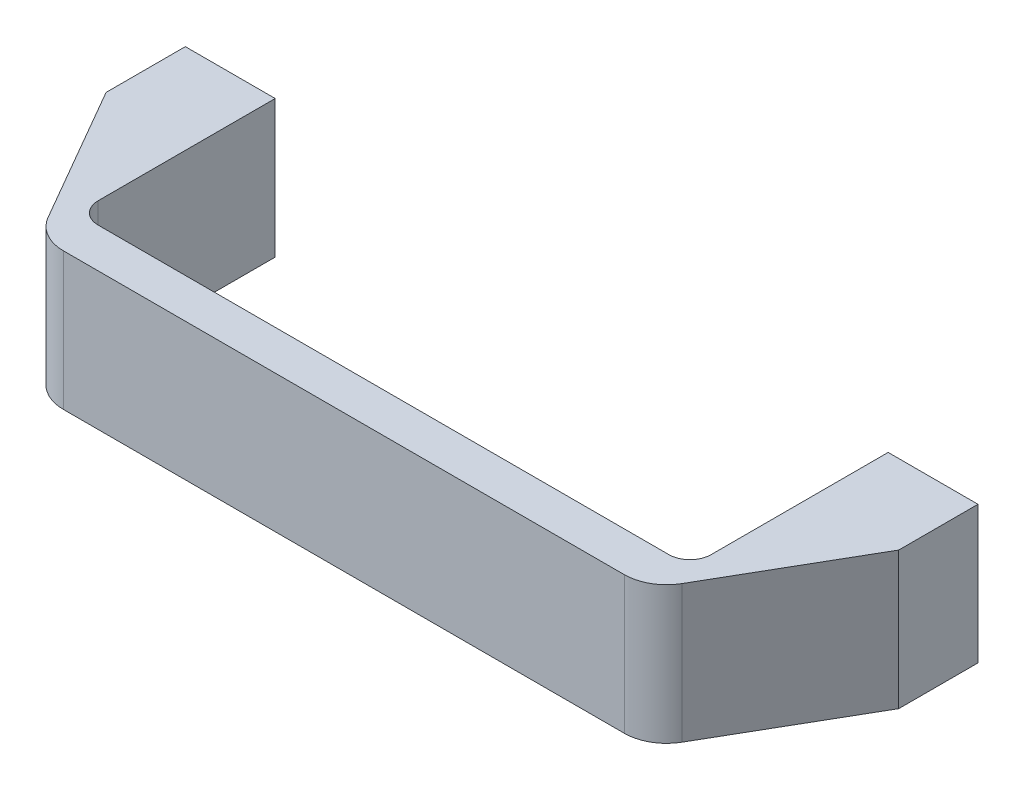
ISO-10303-21;
HEADER;
FILE_DESCRIPTION(('STEP AP214'),'2;1');
FILE_NAME('part.step','',(''),(''),'','','');
FILE_SCHEMA(('AUTOMOTIVE_DESIGN { 1 0 10303 214 1 1 1 1 }'));
ENDSEC;
DATA;
#1=APPLICATION_CONTEXT('core data for automotive mechanical design processes');
#2=APPLICATION_PROTOCOL_DEFINITION('international standard','automotive_design',2000,#1);
#3=PRODUCT_CONTEXT('',#1,'mechanical');
#4=PRODUCT('Part','Part','',(#3));
#5=PRODUCT_RELATED_PRODUCT_CATEGORY('part','',(#4));
#6=PRODUCT_DEFINITION_FORMATION('','',#4);
#7=PRODUCT_DEFINITION_CONTEXT('part definition',#1,'design');
#8=PRODUCT_DEFINITION('design','',#6,#7);
#9=PRODUCT_DEFINITION_SHAPE('','',#8);
#10=(LENGTH_UNIT() NAMED_UNIT(*) SI_UNIT(.MILLI.,.METRE.));
#11=(NAMED_UNIT(*) PLANE_ANGLE_UNIT() SI_UNIT($,.RADIAN.));
#12=(NAMED_UNIT(*) SI_UNIT($,.STERADIAN.) SOLID_ANGLE_UNIT());
#13=UNCERTAINTY_MEASURE_WITH_UNIT(LENGTH_MEASURE(1.E-05),#10,'distance_accuracy_value','');
#14=(GEOMETRIC_REPRESENTATION_CONTEXT(3) GLOBAL_UNCERTAINTY_ASSIGNED_CONTEXT((#13)) GLOBAL_UNIT_ASSIGNED_CONTEXT((#10,
#11,#12)) REPRESENTATION_CONTEXT('',''));
#15=CARTESIAN_POINT('',(0.,0.,0.));
#16=DIRECTION('',(0.,0.,1.));
#17=DIRECTION('',(1.,0.,0.));
#18=AXIS2_PLACEMENT_3D('',#15,#16,#17);
#19=CARTESIAN_POINT('',(-9.,-13.,0.));
#20=DIRECTION('',(0.,0.,-1.));
#21=DIRECTION('',(0.,1.,0.));
#22=AXIS2_PLACEMENT_3D('',#19,#20,#21);
#23=PLANE('',#22);
#24=DIRECTION('',(1.,0.,0.));
#25=VECTOR('',#24,1.);
#26=CARTESIAN_POINT('',(66.,-13.,0.));
#27=LINE('',#26,#25);
#28=CARTESIAN_POINT('',(-9.,-13.,0.));
#29=VERTEX_POINT('',#28);
#30=CARTESIAN_POINT('',(8.,-13.,0.));
#31=VERTEX_POINT('',#30);
#32=EDGE_CURVE('E130',#29,#31,#27,.T.);
#33=ORIENTED_EDGE('',*,*,#32,.F.);
#34=DIRECTION('',(0.,-1.,0.));
#35=VECTOR('',#34,1.);
#36=CARTESIAN_POINT('',(-9.,-13.,0.));
#37=LINE('',#36,#35);
#38=CARTESIAN_POINT('',(-9.,13.,0.));
#39=VERTEX_POINT('',#38);
#40=EDGE_CURVE('E138',#39,#29,#37,.T.);
#41=ORIENTED_EDGE('',*,*,#40,.F.);
#42=DIRECTION('',(1.,0.,0.));
#43=VECTOR('',#42,1.);
#44=CARTESIAN_POINT('',(66.,13.,0.));
#45=LINE('',#44,#43);
#46=CARTESIAN_POINT('',(8.,13.,0.));
#47=VERTEX_POINT('',#46);
#48=EDGE_CURVE('E137',#39,#47,#45,.T.);
#49=ORIENTED_EDGE('',*,*,#48,.T.);
#50=DIRECTION('',(0.,1.,0.));
#51=VECTOR('',#50,1.);
#52=CARTESIAN_POINT('',(8.,-13.,0.));
#53=LINE('',#52,#51);
#54=EDGE_CURVE('E133',#31,#47,#53,.T.);
#55=ORIENTED_EDGE('',*,*,#54,.F.);
#56=EDGE_LOOP('',(#33,#41,#49,#55));
#57=FACE_BOUND('',#56,.T.);
#58=CARTESIAN_POINT('',(0.,0.,0.));
#59=DIRECTION('',(0.,0.,-1.));
#60=DIRECTION('',(0.,1.,0.));
#61=AXIS2_PLACEMENT_3D('',#58,#59,#60);
#62=CIRCLE('',#61,4.);
#63=CARTESIAN_POINT('',(0.,4.,0.));
#64=VERTEX_POINT('',#63);
#65=EDGE_CURVE('E326',#64,#64,#62,.T.);
#66=ORIENTED_EDGE('',*,*,#65,.F.);
#67=EDGE_LOOP('',(#66));
#68=FACE_BOUND('',#67,.T.);
#69=ADVANCED_FACE('F14',(#57,#68),#23,.T.);
#70=CARTESIAN_POINT('',(124.,-13.,33.5));
#71=DIRECTION('',(-1.,0.,0.));
#72=DIRECTION('',(0.,-1.,0.));
#73=AXIS2_PLACEMENT_3D('',#70,#71,#72);
#74=PLANE('',#73);
#75=DIRECTION('',(0.,0.,1.));
#76=VECTOR('',#75,1.);
#77=CARTESIAN_POINT('',(124.,-13.,0.));
#78=LINE('',#77,#76);
#79=CARTESIAN_POINT('',(124.,-13.,33.5));
#80=VERTEX_POINT('',#79);
#81=CARTESIAN_POINT('',(124.,-13.,0.));
#82=VERTEX_POINT('',#81);
#83=EDGE_CURVE('E183',#80,#82,#78,.F.);
#84=ORIENTED_EDGE('',*,*,#83,.F.);
#85=DIRECTION('',(0.,-1.,0.));
#86=VECTOR('',#85,1.);
#87=CARTESIAN_POINT('',(124.,-13.,33.5));
#88=LINE('',#87,#86);
#89=CARTESIAN_POINT('',(124.,13.,33.5));
#90=VERTEX_POINT('',#89);
#91=EDGE_CURVE('E186',#80,#90,#88,.F.);
#92=ORIENTED_EDGE('',*,*,#91,.T.);
#93=DIRECTION('',(0.,0.,1.));
#94=VECTOR('',#93,1.);
#95=CARTESIAN_POINT('',(124.,13.,0.));
#96=LINE('',#95,#94);
#97=CARTESIAN_POINT('',(124.,13.,0.));
#98=VERTEX_POINT('',#97);
#99=EDGE_CURVE('E165',#90,#98,#96,.F.);
#100=ORIENTED_EDGE('',*,*,#99,.T.);
#101=DIRECTION('',(0.,1.,0.));
#102=VECTOR('',#101,1.);
#103=CARTESIAN_POINT('',(124.,-13.,0.));
#104=LINE('',#103,#102);
#105=EDGE_CURVE('E215',#82,#98,#104,.T.);
#106=ORIENTED_EDGE('',*,*,#105,.F.);
#107=EDGE_LOOP('',(#84,#92,#100,#106));
#108=FACE_BOUND('',#107,.T.);
#109=ADVANCED_FACE('F284',(#108),#74,.T.);
#110=CARTESIAN_POINT('',(124.,-13.,0.));
#111=DIRECTION('',(0.,0.,-1.));
#112=DIRECTION('',(0.,1.,0.));
#113=AXIS2_PLACEMENT_3D('',#110,#111,#112);
#114=PLANE('',#113);
#115=DIRECTION('',(1.,0.,0.));
#116=VECTOR('',#115,1.);
#117=CARTESIAN_POINT('',(66.,-13.,0.));
#118=LINE('',#117,#116);
#119=CARTESIAN_POINT('',(141.,-13.,0.));
#120=VERTEX_POINT('',#119);
#121=EDGE_CURVE('E213',#82,#120,#118,.T.);
#122=ORIENTED_EDGE('',*,*,#121,.F.);
#123=ORIENTED_EDGE('',*,*,#105,.T.);
#124=DIRECTION('',(1.,0.,0.));
#125=VECTOR('',#124,1.);
#126=CARTESIAN_POINT('',(66.,13.,0.));
#127=LINE('',#126,#125);
#128=CARTESIAN_POINT('',(141.,13.,0.));
#129=VERTEX_POINT('',#128);
#130=EDGE_CURVE('E163',#98,#129,#127,.T.);
#131=ORIENTED_EDGE('',*,*,#130,.T.);
#132=DIRECTION('',(0.,1.,0.));
#133=VECTOR('',#132,1.);
#134=CARTESIAN_POINT('',(141.,-13.,0.));
#135=LINE('',#134,#133);
#136=EDGE_CURVE('E209',#120,#129,#135,.T.);
#137=ORIENTED_EDGE('',*,*,#136,.F.);
#138=EDGE_LOOP('',(#122,#123,#131,#137));
#139=FACE_BOUND('',#138,.T.);
#140=CARTESIAN_POINT('',(132.,0.,0.));
#141=DIRECTION('',(0.,0.,-1.));
#142=DIRECTION('',(0.,1.,0.));
#143=AXIS2_PLACEMENT_3D('',#140,#141,#142);
#144=CIRCLE('',#143,4.);
#145=CARTESIAN_POINT('',(132.,4.,0.));
#146=VERTEX_POINT('',#145);
#147=EDGE_CURVE('E229',#146,#146,#144,.T.);
#148=ORIENTED_EDGE('',*,*,#147,.F.);
#149=EDGE_LOOP('',(#148));
#150=FACE_BOUND('',#149,.T.);
#151=ADVANCED_FACE('F288',(#139,#150),#114,.T.);
#152=CARTESIAN_POINT('',(141.,-13.,0.));
#153=DIRECTION('',(1.,0.,0.));
#154=DIRECTION('',(0.,1.,0.));
#155=AXIS2_PLACEMENT_3D('',#152,#153,#154);
#156=PLANE('',#155);
#157=DIRECTION('',(0.,0.,1.));
#158=VECTOR('',#157,1.);
#159=CARTESIAN_POINT('',(141.,-13.,0.));
#160=LINE('',#159,#158);
#161=CARTESIAN_POINT('',(141.,-13.,15.));
#162=VERTEX_POINT('',#161);
#163=EDGE_CURVE('E210',#120,#162,#160,.T.);
#164=ORIENTED_EDGE('',*,*,#163,.F.);
#165=ORIENTED_EDGE('',*,*,#136,.T.);
#166=DIRECTION('',(0.,0.,1.));
#167=VECTOR('',#166,1.);
#168=CARTESIAN_POINT('',(141.,13.,0.));
#169=LINE('',#168,#167);
#170=CARTESIAN_POINT('',(141.,13.,15.));
#171=VERTEX_POINT('',#170);
#172=EDGE_CURVE('E90',#129,#171,#169,.T.);
#173=ORIENTED_EDGE('',*,*,#172,.T.);
#174=DIRECTION('',(0.,-1.,0.));
#175=VECTOR('',#174,1.);
#176=CARTESIAN_POINT('',(141.,-13.,15.));
#177=LINE('',#176,#175);
#178=EDGE_CURVE('E207',#162,#171,#177,.F.);
#179=ORIENTED_EDGE('',*,*,#178,.F.);
#180=EDGE_LOOP('',(#164,#165,#173,#179));
#181=FACE_BOUND('',#180,.T.);
#182=ADVANCED_FACE('F291',(#181),#156,.T.);
#183=CARTESIAN_POINT('',(141.,-13.,15.));
#184=DIRECTION('',(0.866025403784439,0.,0.5));
#185=DIRECTION('',(-0.5,0.,0.866025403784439));
#186=AXIS2_PLACEMENT_3D('',#183,#184,#185);
#187=PLANE('',#186);
#188=DIRECTION('',(-0.5,0.,0.866025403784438));
#189=VECTOR('',#188,1.);
#190=CARTESIAN_POINT('',(141.,-13.,15.));
#191=LINE('',#190,#189);
#192=CARTESIAN_POINT('',(125.98889300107,-13.,41.));
#193=VERTEX_POINT('',#192);
#194=EDGE_CURVE('E179',#162,#193,#191,.T.);
#195=ORIENTED_EDGE('',*,*,#194,.F.);
#196=ORIENTED_EDGE('',*,*,#178,.T.);
#197=DIRECTION('',(-0.5,0.,0.866025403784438));
#198=VECTOR('',#197,1.);
#199=CARTESIAN_POINT('',(141.,13.,15.));
#200=LINE('',#199,#198);
#201=CARTESIAN_POINT('',(125.98889300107,13.,41.));
#202=VERTEX_POINT('',#201);
#203=EDGE_CURVE('E80',#171,#202,#200,.T.);
#204=ORIENTED_EDGE('',*,*,#203,.T.);
#205=DIRECTION('',(0.,-1.,0.));
#206=VECTOR('',#205,1.);
#207=CARTESIAN_POINT('',(125.98889300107,-13.,41.));
#208=LINE('',#207,#206);
#209=EDGE_CURVE('E205',#193,#202,#208,.F.);
#210=ORIENTED_EDGE('',*,*,#209,.F.);
#211=EDGE_LOOP('',(#195,#196,#204,#210));
#212=FACE_BOUND('',#211,.T.);
#213=ADVANCED_FACE('F293',(#212),#187,.T.);
#214=CARTESIAN_POINT('',(119.060689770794,-13.,37.));
#215=DIRECTION('',(0.,-1.,0.));
#216=DIRECTION('',(1.,0.,0.));
#217=AXIS2_PLACEMENT_3D('',#214,#215,#216);
#218=CYLINDRICAL_SURFACE('',#217,8.);
#219=CARTESIAN_POINT('',(119.060689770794,-13.,37.));
#220=DIRECTION('',(0.,-1.,0.));
#221=DIRECTION('',(1.,0.,0.));
#222=AXIS2_PLACEMENT_3D('',#219,#220,#221);
#223=CIRCLE('',#222,8.);
#224=CARTESIAN_POINT('',(119.060689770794,-13.,45.));
#225=VERTEX_POINT('',#224);
#226=EDGE_CURVE('E176',#193,#225,#223,.T.);
#227=ORIENTED_EDGE('',*,*,#226,.F.);
#228=ORIENTED_EDGE('',*,*,#209,.T.);
#229=CARTESIAN_POINT('',(119.060689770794,13.,37.));
#230=DIRECTION('',(0.,-1.,0.));
#231=DIRECTION('',(1.,0.,0.));
#232=AXIS2_PLACEMENT_3D('',#229,#230,#231);
#233=CIRCLE('',#232,8.);
#234=CARTESIAN_POINT('',(119.060689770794,13.,45.));
#235=VERTEX_POINT('',#234);
#236=EDGE_CURVE('E17',#202,#235,#233,.T.);
#237=ORIENTED_EDGE('',*,*,#236,.T.);
#238=DIRECTION('',(0.,-1.,0.));
#239=VECTOR('',#238,1.);
#240=CARTESIAN_POINT('',(119.060689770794,-13.,45.));
#241=LINE('',#240,#239);
#242=EDGE_CURVE('E203',#225,#235,#241,.F.);
#243=ORIENTED_EDGE('',*,*,#242,.F.);
#244=EDGE_LOOP('',(#227,#228,#237,#243));
#245=FACE_BOUND('',#244,.T.);
#246=ADVANCED_FACE('F297',(#245),#218,.T.);
#247=CARTESIAN_POINT('',(66.,-13.,45.));
#248=DIRECTION('',(0.,0.,1.));
#249=DIRECTION('',(0.,-1.,0.));
#250=AXIS2_PLACEMENT_3D('',#247,#248,#249);
#251=PLANE('',#250);
#252=DIRECTION('',(1.,0.,0.));
#253=VECTOR('',#252,1.);
#254=CARTESIAN_POINT('',(66.,-13.,45.));
#255=LINE('',#254,#253);
#256=CARTESIAN_POINT('',(12.9393102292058,-13.,45.));
#257=VERTEX_POINT('',#256);
#258=EDGE_CURVE('E175',#225,#257,#255,.F.);
#259=ORIENTED_EDGE('',*,*,#258,.F.);
#260=ORIENTED_EDGE('',*,*,#242,.T.);
#261=DIRECTION('',(1.,0.,0.));
#262=VECTOR('',#261,1.);
#263=CARTESIAN_POINT('',(66.,13.,45.));
#264=LINE('',#263,#262);
#265=CARTESIAN_POINT('',(12.9393102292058,13.,45.));
#266=VERTEX_POINT('',#265);
#267=EDGE_CURVE('E187',#235,#266,#264,.F.);
#268=ORIENTED_EDGE('',*,*,#267,.T.);
#269=DIRECTION('',(0.,-1.,0.));
#270=VECTOR('',#269,1.);
#271=CARTESIAN_POINT('',(12.9393102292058,-13.,45.));
#272=LINE('',#271,#270);
#273=EDGE_CURVE('E200',#257,#266,#272,.F.);
#274=ORIENTED_EDGE('',*,*,#273,.F.);
#275=EDGE_LOOP('',(#259,#260,#268,#274));
#276=FACE_BOUND('',#275,.T.);
#277=ADVANCED_FACE('F299',(#276),#251,.T.);
#278=CARTESIAN_POINT('',(12.9393102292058,-13.,37.));
#279=DIRECTION('',(0.,-1.,0.));
#280=DIRECTION('',(1.,0.,0.));
#281=AXIS2_PLACEMENT_3D('',#278,#279,#280);
#282=CYLINDRICAL_SURFACE('',#281,8.);
#283=CARTESIAN_POINT('',(12.9393102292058,-13.,37.));
#284=DIRECTION('',(0.,-1.,0.));
#285=DIRECTION('',(1.,0.,0.));
#286=AXIS2_PLACEMENT_3D('',#283,#284,#285);
#287=CIRCLE('',#286,8.);
#288=CARTESIAN_POINT('',(6.0111069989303,-13.,41.));
#289=VERTEX_POINT('',#288);
#290=EDGE_CURVE('E171',#257,#289,#287,.T.);
#291=ORIENTED_EDGE('',*,*,#290,.F.);
#292=ORIENTED_EDGE('',*,*,#273,.T.);
#293=CARTESIAN_POINT('',(12.9393102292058,13.,37.));
#294=DIRECTION('',(0.,-1.,0.));
#295=DIRECTION('',(1.,0.,0.));
#296=AXIS2_PLACEMENT_3D('',#293,#294,#295);
#297=CIRCLE('',#296,8.);
#298=CARTESIAN_POINT('',(6.0111069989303,13.,41.));
#299=VERTEX_POINT('',#298);
#300=EDGE_CURVE('E149',#266,#299,#297,.T.);
#301=ORIENTED_EDGE('',*,*,#300,.T.);
#302=DIRECTION('',(0.,-1.,0.));
#303=VECTOR('',#302,1.);
#304=CARTESIAN_POINT('',(6.0111069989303,-13.,41.));
#305=LINE('',#304,#303);
#306=EDGE_CURVE('E144',#289,#299,#305,.F.);
#307=ORIENTED_EDGE('',*,*,#306,.F.);
#308=EDGE_LOOP('',(#291,#292,#301,#307));
#309=FACE_BOUND('',#308,.T.);
#310=ADVANCED_FACE('F300',(#309),#282,.T.);
#311=CARTESIAN_POINT('',(6.0111069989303,-13.,41.));
#312=DIRECTION('',(-0.866025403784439,0.,0.5));
#313=DIRECTION('',(-0.5,0.,-0.866025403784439));
#314=AXIS2_PLACEMENT_3D('',#311,#312,#313);
#315=PLANE('',#314);
#316=DIRECTION('',(-0.5,0.,-0.866025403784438));
#317=VECTOR('',#316,1.);
#318=CARTESIAN_POINT('',(6.0111069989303,-13.,41.));
#319=LINE('',#318,#317);
#320=CARTESIAN_POINT('',(-9.,-13.,15.));
#321=VERTEX_POINT('',#320);
#322=EDGE_CURVE('E174',#289,#321,#319,.T.);
#323=ORIENTED_EDGE('',*,*,#322,.F.);
#324=ORIENTED_EDGE('',*,*,#306,.T.);
#325=DIRECTION('',(-0.5,0.,-0.866025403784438));
#326=VECTOR('',#325,1.);
#327=CARTESIAN_POINT('',(6.0111069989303,13.,41.));
#328=LINE('',#327,#326);
#329=CARTESIAN_POINT('',(-9.,13.,15.));
#330=VERTEX_POINT('',#329);
#331=EDGE_CURVE('E142',#299,#330,#328,.T.);
#332=ORIENTED_EDGE('',*,*,#331,.T.);
#333=DIRECTION('',(0.,-1.,0.));
#334=VECTOR('',#333,1.);
#335=CARTESIAN_POINT('',(-9.,-13.,15.));
#336=LINE('',#335,#334);
#337=EDGE_CURVE('E121',#321,#330,#336,.F.);
#338=ORIENTED_EDGE('',*,*,#337,.F.);
#339=EDGE_LOOP('',(#323,#324,#332,#338));
#340=FACE_BOUND('',#339,.T.);
#341=ADVANCED_FACE('F143',(#340),#315,.T.);
#342=CARTESIAN_POINT('',(-9.,-13.,15.));
#343=DIRECTION('',(-1.,0.,0.));
#344=DIRECTION('',(0.,-1.,0.));
#345=AXIS2_PLACEMENT_3D('',#342,#343,#344);
#346=PLANE('',#345);
#347=DIRECTION('',(0.,0.,1.));
#348=VECTOR('',#347,1.);
#349=CARTESIAN_POINT('',(-9.,-13.,0.));
#350=LINE('',#349,#348);
#351=EDGE_CURVE('E154',#321,#29,#350,.F.);
#352=ORIENTED_EDGE('',*,*,#351,.F.);
#353=ORIENTED_EDGE('',*,*,#337,.T.);
#354=DIRECTION('',(0.,0.,1.));
#355=VECTOR('',#354,1.);
#356=CARTESIAN_POINT('',(-9.,13.,0.));
#357=LINE('',#356,#355);
#358=EDGE_CURVE('E148',#330,#39,#357,.F.);
#359=ORIENTED_EDGE('',*,*,#358,.T.);
#360=ORIENTED_EDGE('',*,*,#40,.T.);
#361=EDGE_LOOP('',(#352,#353,#359,#360));
#362=FACE_BOUND('',#361,.T.);
#363=ADVANCED_FACE('F152',(#362),#346,.T.);
#364=CARTESIAN_POINT('',(8.,-13.,0.));
#365=DIRECTION('',(1.,0.,0.));
#366=DIRECTION('',(0.,1.,0.));
#367=AXIS2_PLACEMENT_3D('',#364,#365,#366);
#368=PLANE('',#367);
#369=DIRECTION('',(0.,0.,1.));
#370=VECTOR('',#369,1.);
#371=CARTESIAN_POINT('',(8.,-13.,0.));
#372=LINE('',#371,#370);
#373=CARTESIAN_POINT('',(8.,-13.,33.5));
#374=VERTEX_POINT('',#373);
#375=EDGE_CURVE('E184',#31,#374,#372,.T.);
#376=ORIENTED_EDGE('',*,*,#375,.F.);
#377=ORIENTED_EDGE('',*,*,#54,.T.);
#378=DIRECTION('',(0.,0.,1.));
#379=VECTOR('',#378,1.);
#380=CARTESIAN_POINT('',(8.,13.,0.));
#381=LINE('',#380,#379);
#382=CARTESIAN_POINT('',(8.,13.,33.5));
#383=VERTEX_POINT('',#382);
#384=EDGE_CURVE('E113',#47,#383,#381,.T.);
#385=ORIENTED_EDGE('',*,*,#384,.T.);
#386=DIRECTION('',(0.,-1.,0.));
#387=VECTOR('',#386,1.);
#388=CARTESIAN_POINT('',(8.,-13.,33.5));
#389=LINE('',#388,#387);
#390=EDGE_CURVE('E170',#383,#374,#389,.T.);
#391=ORIENTED_EDGE('',*,*,#390,.T.);
#392=EDGE_LOOP('',(#376,#377,#385,#391));
#393=FACE_BOUND('',#392,.T.);
#394=ADVANCED_FACE('F252',(#393),#368,.T.);
#395=CARTESIAN_POINT('',(66.,13.,0.));
#396=DIRECTION('',(0.,-1.,0.));
#397=DIRECTION('',(1.,0.,0.));
#398=AXIS2_PLACEMENT_3D('',#395,#396,#397);
#399=PLANE('',#398);
#400=ORIENTED_EDGE('',*,*,#48,.F.);
#401=ORIENTED_EDGE('',*,*,#358,.F.);
#402=ORIENTED_EDGE('',*,*,#331,.F.);
#403=ORIENTED_EDGE('',*,*,#300,.F.);
#404=ORIENTED_EDGE('',*,*,#267,.F.);
#405=ORIENTED_EDGE('',*,*,#236,.F.);
#406=ORIENTED_EDGE('',*,*,#203,.F.);
#407=ORIENTED_EDGE('',*,*,#172,.F.);
#408=ORIENTED_EDGE('',*,*,#130,.F.);
#409=ORIENTED_EDGE('',*,*,#99,.F.);
#410=CARTESIAN_POINT('',(120.,13.,33.5));
#411=DIRECTION('',(0.,-1.,0.));
#412=DIRECTION('',(1.,0.,0.));
#413=AXIS2_PLACEMENT_3D('',#410,#411,#412);
#414=CIRCLE('',#413,4.);
#415=CARTESIAN_POINT('',(120.,13.,37.5));
#416=VERTEX_POINT('',#415);
#417=EDGE_CURVE('E185',#90,#416,#414,.T.);
#418=ORIENTED_EDGE('',*,*,#417,.T.);
#419=DIRECTION('',(1.,0.,0.));
#420=VECTOR('',#419,1.);
#421=CARTESIAN_POINT('',(12.,13.,37.5));
#422=LINE('',#421,#420);
#423=CARTESIAN_POINT('',(12.,13.,37.5));
#424=VERTEX_POINT('',#423);
#425=EDGE_CURVE('E168',#424,#416,#422,.T.);
#426=ORIENTED_EDGE('',*,*,#425,.F.);
#427=CARTESIAN_POINT('',(12.,13.,33.5));
#428=DIRECTION('',(0.,-1.,0.));
#429=DIRECTION('',(1.,0.,0.));
#430=AXIS2_PLACEMENT_3D('',#427,#428,#429);
#431=CIRCLE('',#430,4.);
#432=EDGE_CURVE('E166',#424,#383,#431,.T.);
#433=ORIENTED_EDGE('',*,*,#432,.T.);
#434=ORIENTED_EDGE('',*,*,#384,.F.);
#435=EDGE_LOOP('',(#400,#401,#402,#403,#404,#405,#406,#407,#408,#409,#418,#426,#433,#434));
#436=FACE_BOUND('',#435,.T.);
#437=ADVANCED_FACE('F157',(#436),#399,.F.);
#438=CARTESIAN_POINT('',(120.,-13.,33.5));
#439=DIRECTION('',(0.,-1.,0.));
#440=DIRECTION('',(1.,0.,0.));
#441=AXIS2_PLACEMENT_3D('',#438,#439,#440);
#442=CYLINDRICAL_SURFACE('',#441,4.);
#443=ORIENTED_EDGE('',*,*,#91,.F.);
#444=CARTESIAN_POINT('',(120.,-13.,33.5));
#445=DIRECTION('',(0.,-1.,0.));
#446=DIRECTION('',(1.,0.,0.));
#447=AXIS2_PLACEMENT_3D('',#444,#445,#446);
#448=CIRCLE('',#447,4.);
#449=CARTESIAN_POINT('',(120.,-13.,37.5));
#450=VERTEX_POINT('',#449);
#451=EDGE_CURVE('E180',#450,#80,#448,.F.);
#452=ORIENTED_EDGE('',*,*,#451,.F.);
#453=DIRECTION('',(0.,1.,0.));
#454=VECTOR('',#453,1.);
#455=CARTESIAN_POINT('',(120.,-13.,37.5));
#456=LINE('',#455,#454);
#457=EDGE_CURVE('E237',#416,#450,#456,.F.);
#458=ORIENTED_EDGE('',*,*,#457,.F.);
#459=ORIENTED_EDGE('',*,*,#417,.F.);
#460=EDGE_LOOP('',(#443,#452,#458,#459));
#461=FACE_BOUND('',#460,.T.);
#462=ADVANCED_FACE('F260',(#461),#442,.F.);
#463=CARTESIAN_POINT('',(66.,-13.,0.));
#464=DIRECTION('',(0.,-1.,0.));
#465=DIRECTION('',(1.,0.,0.));
#466=AXIS2_PLACEMENT_3D('',#463,#464,#465);
#467=PLANE('',#466);
#468=ORIENTED_EDGE('',*,*,#322,.T.);
#469=ORIENTED_EDGE('',*,*,#351,.T.);
#470=ORIENTED_EDGE('',*,*,#32,.T.);
#471=ORIENTED_EDGE('',*,*,#375,.T.);
#472=CARTESIAN_POINT('',(12.,-13.,33.5));
#473=DIRECTION('',(0.,-1.,0.));
#474=DIRECTION('',(1.,0.,0.));
#475=AXIS2_PLACEMENT_3D('',#472,#473,#474);
#476=CIRCLE('',#475,4.);
#477=CARTESIAN_POINT('',(12.,-13.,37.5));
#478=VERTEX_POINT('',#477);
#479=EDGE_CURVE('E32',#374,#478,#476,.F.);
#480=ORIENTED_EDGE('',*,*,#479,.T.);
#481=DIRECTION('',(1.,0.,0.));
#482=VECTOR('',#481,1.);
#483=CARTESIAN_POINT('',(12.,-13.,37.5));
#484=LINE('',#483,#482);
#485=EDGE_CURVE('E23',#450,#478,#484,.F.);
#486=ORIENTED_EDGE('',*,*,#485,.F.);
#487=ORIENTED_EDGE('',*,*,#451,.T.);
#488=ORIENTED_EDGE('',*,*,#83,.T.);
#489=ORIENTED_EDGE('',*,*,#121,.T.);
#490=ORIENTED_EDGE('',*,*,#163,.T.);
#491=ORIENTED_EDGE('',*,*,#194,.T.);
#492=ORIENTED_EDGE('',*,*,#226,.T.);
#493=ORIENTED_EDGE('',*,*,#258,.T.);
#494=ORIENTED_EDGE('',*,*,#290,.T.);
#495=EDGE_LOOP('',(#468,#469,#470,#471,#480,#486,#487,#488,#489,#490,#491,#492,#493,#494));
#496=FACE_BOUND('',#495,.T.);
#497=ADVANCED_FACE('F223',(#496),#467,.T.);
#498=CARTESIAN_POINT('',(12.,-13.,33.5));
#499=DIRECTION('',(0.,-1.,0.));
#500=DIRECTION('',(1.,0.,0.));
#501=AXIS2_PLACEMENT_3D('',#498,#499,#500);
#502=CYLINDRICAL_SURFACE('',#501,4.);
#503=DIRECTION('',(0.,1.,0.));
#504=VECTOR('',#503,1.);
#505=CARTESIAN_POINT('',(12.,-13.,37.5));
#506=LINE('',#505,#504);
#507=EDGE_CURVE('E9',#478,#424,#506,.T.);
#508=ORIENTED_EDGE('',*,*,#507,.F.);
#509=ORIENTED_EDGE('',*,*,#479,.F.);
#510=ORIENTED_EDGE('',*,*,#390,.F.);
#511=ORIENTED_EDGE('',*,*,#432,.F.);
#512=EDGE_LOOP('',(#508,#509,#510,#511));
#513=FACE_BOUND('',#512,.T.);
#514=ADVANCED_FACE('F251',(#513),#502,.F.);
#515=CARTESIAN_POINT('',(12.,-13.,37.5));
#516=DIRECTION('',(0.,0.,-1.));
#517=DIRECTION('',(0.,1.,0.));
#518=AXIS2_PLACEMENT_3D('',#515,#516,#517);
#519=PLANE('',#518);
#520=ORIENTED_EDGE('',*,*,#485,.T.);
#521=ORIENTED_EDGE('',*,*,#507,.T.);
#522=ORIENTED_EDGE('',*,*,#425,.T.);
#523=ORIENTED_EDGE('',*,*,#457,.T.);
#524=EDGE_LOOP('',(#520,#521,#522,#523));
#525=FACE_BOUND('',#524,.T.);
#526=ADVANCED_FACE('F244',(#525),#519,.T.);
#527=CARTESIAN_POINT('',(132.,0.,13.));
#528=DIRECTION('',(0.,0.,-1.));
#529=DIRECTION('',(0.,1.,0.));
#530=AXIS2_PLACEMENT_3D('',#527,#528,#529);
#531=PLANE('',#530);
#532=CARTESIAN_POINT('',(132.,0.,13.));
#533=DIRECTION('',(0.,0.,-1.));
#534=DIRECTION('',(0.,1.,0.));
#535=AXIS2_PLACEMENT_3D('',#532,#533,#534);
#536=CIRCLE('',#535,4.);
#537=CARTESIAN_POINT('',(132.,4.,13.));
#538=VERTEX_POINT('',#537);
#539=EDGE_CURVE('E220',#538,#538,#536,.T.);
#540=ORIENTED_EDGE('',*,*,#539,.T.);
#541=EDGE_LOOP('',(#540));
#542=FACE_BOUND('',#541,.T.);
#543=ADVANCED_FACE('F264',(#542),#531,.T.);
#544=CARTESIAN_POINT('',(132.,0.,13.));
#545=DIRECTION('',(0.,0.,-1.));
#546=DIRECTION('',(0.,1.,0.));
#547=AXIS2_PLACEMENT_3D('',#544,#545,#546);
#548=CYLINDRICAL_SURFACE('',#547,4.);
#549=ORIENTED_EDGE('',*,*,#539,.F.);
#550=EDGE_LOOP('',(#549));
#551=FACE_BOUND('',#550,.T.);
#552=ORIENTED_EDGE('',*,*,#147,.T.);
#553=EDGE_LOOP('',(#552));
#554=FACE_BOUND('',#553,.T.);
#555=ADVANCED_FACE('F270',(#551,#554),#548,.F.);
#556=CARTESIAN_POINT('',(0.,0.,13.));
#557=DIRECTION('',(0.,0.,-1.));
#558=DIRECTION('',(0.,1.,0.));
#559=AXIS2_PLACEMENT_3D('',#556,#557,#558);
#560=PLANE('',#559);
#561=CARTESIAN_POINT('',(0.,0.,13.));
#562=DIRECTION('',(0.,0.,-1.));
#563=DIRECTION('',(0.,1.,0.));
#564=AXIS2_PLACEMENT_3D('',#561,#562,#563);
#565=CIRCLE('',#564,4.);
#566=CARTESIAN_POINT('',(0.,4.,13.));
#567=VERTEX_POINT('',#566);
#568=EDGE_CURVE('E328',#567,#567,#565,.T.);
#569=ORIENTED_EDGE('',*,*,#568,.T.);
#570=EDGE_LOOP('',(#569));
#571=FACE_BOUND('',#570,.T.);
#572=ADVANCED_FACE('F338',(#571),#560,.T.);
#573=CARTESIAN_POINT('',(0.,0.,13.));
#574=DIRECTION('',(0.,0.,-1.));
#575=DIRECTION('',(0.,1.,0.));
#576=AXIS2_PLACEMENT_3D('',#573,#574,#575);
#577=CYLINDRICAL_SURFACE('',#576,4.);
#578=ORIENTED_EDGE('',*,*,#568,.F.);
#579=EDGE_LOOP('',(#578));
#580=FACE_BOUND('',#579,.T.);
#581=ORIENTED_EDGE('',*,*,#65,.T.);
#582=EDGE_LOOP('',(#581));
#583=FACE_BOUND('',#582,.T.);
#584=ADVANCED_FACE('F343',(#580,#583),#577,.F.);
#585=CLOSED_SHELL('',(#69,#109,#151,#182,#213,#246,#277,#310,#341,#363,#394,#437,#462,#497,#514,
#526,#543,#555,#572,#584));
#586=MANIFOLD_SOLID_BREP('B1',#585);
#587=ADVANCED_BREP_SHAPE_REPRESENTATION('',(#18,#586),#14);
#588=SHAPE_DEFINITION_REPRESENTATION(#9,#587);
ENDSEC;
END-ISO-10303-21;
